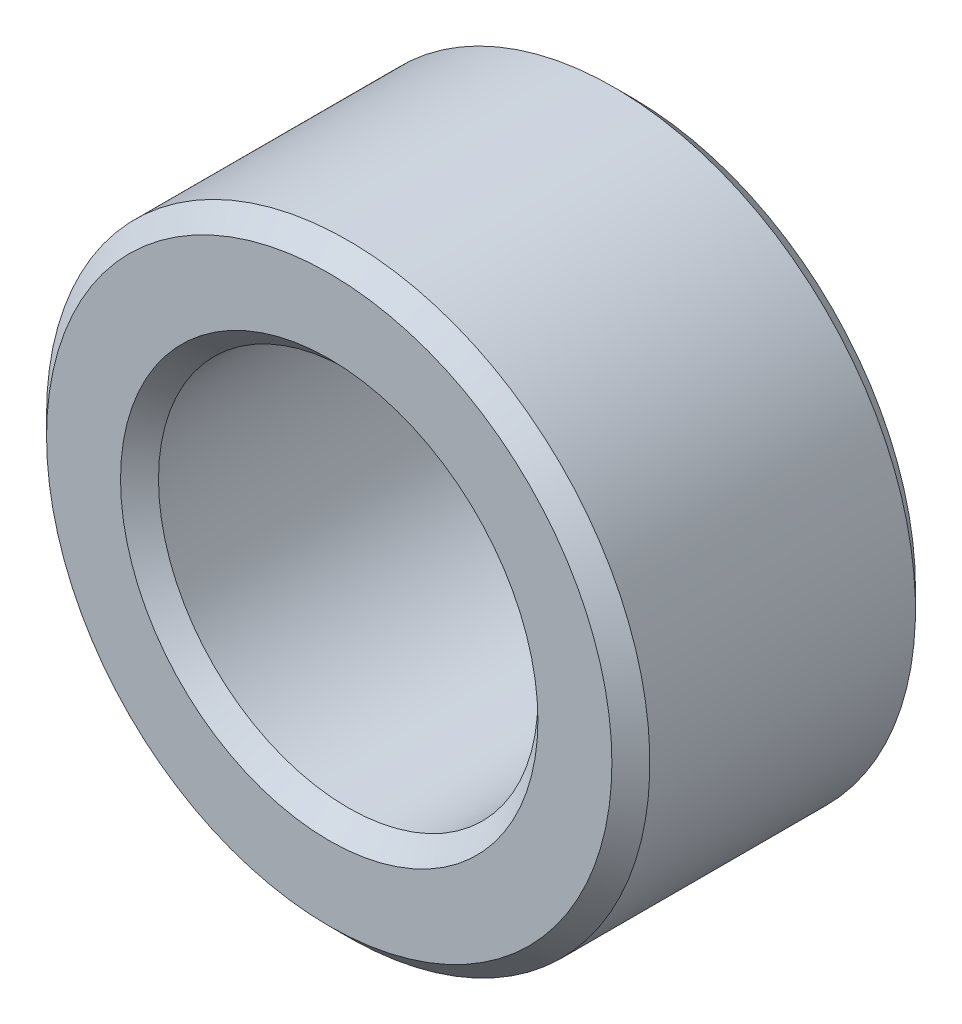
ISO-10303-21;
HEADER;
FILE_DESCRIPTION(('STEP AP214'),'2;1');
FILE_NAME('part.step','',(''),(''),'','','');
FILE_SCHEMA(('AUTOMOTIVE_DESIGN { 1 0 10303 214 1 1 1 1 }'));
ENDSEC;
DATA;
#1=APPLICATION_CONTEXT('core data for automotive mechanical design processes');
#2=APPLICATION_PROTOCOL_DEFINITION('international standard','automotive_design',2000,#1);
#3=PRODUCT_CONTEXT('',#1,'mechanical');
#4=PRODUCT('Part','Part','',(#3));
#5=PRODUCT_RELATED_PRODUCT_CATEGORY('part','',(#4));
#6=PRODUCT_DEFINITION_FORMATION('','',#4);
#7=PRODUCT_DEFINITION_CONTEXT('part definition',#1,'design');
#8=PRODUCT_DEFINITION('design','',#6,#7);
#9=PRODUCT_DEFINITION_SHAPE('','',#8);
#10=(LENGTH_UNIT() NAMED_UNIT(*) SI_UNIT(.MILLI.,.METRE.));
#11=(NAMED_UNIT(*) PLANE_ANGLE_UNIT() SI_UNIT($,.RADIAN.));
#12=(NAMED_UNIT(*) SI_UNIT($,.STERADIAN.) SOLID_ANGLE_UNIT());
#13=UNCERTAINTY_MEASURE_WITH_UNIT(LENGTH_MEASURE(1.E-05),#10,'distance_accuracy_value','');
#14=(GEOMETRIC_REPRESENTATION_CONTEXT(3) GLOBAL_UNCERTAINTY_ASSIGNED_CONTEXT((#13)) GLOBAL_UNIT_ASSIGNED_CONTEXT((#10,
#11,#12)) REPRESENTATION_CONTEXT('',''));
#15=CARTESIAN_POINT('',(0.,0.,0.));
#16=DIRECTION('',(0.,0.,1.));
#17=DIRECTION('',(1.,0.,0.));
#18=AXIS2_PLACEMENT_3D('',#15,#16,#17);
#19=CARTESIAN_POINT('',(0.,0.,8.));
#20=DIRECTION('',(0.,0.,-1.));
#21=DIRECTION('',(-1.,0.,0.));
#22=AXIS2_PLACEMENT_3D('',#19,#20,#21);
#23=CYLINDRICAL_SURFACE('',#22,5.);
#24=CARTESIAN_POINT('',(0.,0.,0.5));
#25=DIRECTION('',(0.,0.,-1.));
#26=DIRECTION('',(-1.,0.,0.));
#27=AXIS2_PLACEMENT_3D('',#24,#25,#26);
#28=CIRCLE('',#27,5.);
#29=CARTESIAN_POINT('',(-5.,0.,0.499999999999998));
#30=VERTEX_POINT('',#29);
#31=EDGE_CURVE('E40',#30,#30,#28,.T.);
#32=ORIENTED_EDGE('',*,*,#31,.T.);
#33=EDGE_LOOP('',(#32));
#34=FACE_BOUND('',#33,.T.);
#35=CARTESIAN_POINT('',(0.,0.,7.5));
#36=DIRECTION('',(0.,0.,-1.));
#37=DIRECTION('',(-1.,0.,0.));
#38=AXIS2_PLACEMENT_3D('',#35,#36,#37);
#39=CIRCLE('',#38,5.);
#40=CARTESIAN_POINT('',(-5.,0.,7.5));
#41=VERTEX_POINT('',#40);
#42=EDGE_CURVE('E43',#41,#41,#39,.F.);
#43=ORIENTED_EDGE('',*,*,#42,.T.);
#44=EDGE_LOOP('',(#43));
#45=FACE_BOUND('',#44,.T.);
#46=ADVANCED_FACE('F14',(#34,#45),#23,.F.);
#47=CARTESIAN_POINT('',(0.,0.,8.));
#48=DIRECTION('',(0.,0.,-1.));
#49=DIRECTION('',(-1.,0.,0.));
#50=AXIS2_PLACEMENT_3D('',#47,#48,#49);
#51=CYLINDRICAL_SURFACE('',#50,7.95);
#52=CARTESIAN_POINT('',(0.,0.,0.5));
#53=DIRECTION('',(0.,0.,-1.));
#54=DIRECTION('',(-1.,0.,0.));
#55=AXIS2_PLACEMENT_3D('',#52,#53,#54);
#56=CIRCLE('',#55,7.95);
#57=CARTESIAN_POINT('',(-7.95,0.,0.499999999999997));
#58=VERTEX_POINT('',#57);
#59=EDGE_CURVE('E25',#58,#58,#56,.F.);
#60=ORIENTED_EDGE('',*,*,#59,.T.);
#61=EDGE_LOOP('',(#60));
#62=FACE_BOUND('',#61,.T.);
#63=CARTESIAN_POINT('',(0.,0.,7.5));
#64=DIRECTION('',(0.,0.,-1.));
#65=DIRECTION('',(-1.,0.,0.));
#66=AXIS2_PLACEMENT_3D('',#63,#64,#65);
#67=CIRCLE('',#66,7.95);
#68=CARTESIAN_POINT('',(-7.95,0.,7.5));
#69=VERTEX_POINT('',#68);
#70=EDGE_CURVE('E29',#69,#69,#67,.T.);
#71=ORIENTED_EDGE('',*,*,#70,.T.);
#72=EDGE_LOOP('',(#71));
#73=FACE_BOUND('',#72,.T.);
#74=ADVANCED_FACE('F16',(#62,#73),#51,.T.);
#75=CARTESIAN_POINT('',(0.,0.,8.));
#76=DIRECTION('',(0.,0.,-1.));
#77=DIRECTION('',(-1.,0.,0.));
#78=AXIS2_PLACEMENT_3D('',#75,#76,#77);
#79=PLANE('',#78);
#80=CARTESIAN_POINT('',(0.,0.,8.));
#81=DIRECTION('',(0.,0.,-1.));
#82=DIRECTION('',(-1.,0.,0.));
#83=AXIS2_PLACEMENT_3D('',#80,#81,#82);
#84=CIRCLE('',#83,7.45);
#85=CARTESIAN_POINT('',(-7.45,0.,8.));
#86=VERTEX_POINT('',#85);
#87=EDGE_CURVE('E10',#86,#86,#84,.F.);
#88=ORIENTED_EDGE('',*,*,#87,.T.);
#89=EDGE_LOOP('',(#88));
#90=FACE_BOUND('',#89,.T.);
#91=CARTESIAN_POINT('',(0.,0.,8.));
#92=DIRECTION('',(0.,0.,-1.));
#93=DIRECTION('',(-1.,0.,0.));
#94=AXIS2_PLACEMENT_3D('',#91,#92,#93);
#95=CIRCLE('',#94,5.5);
#96=CARTESIAN_POINT('',(-5.5,0.,8.));
#97=VERTEX_POINT('',#96);
#98=EDGE_CURVE('E21',#97,#97,#95,.T.);
#99=ORIENTED_EDGE('',*,*,#98,.T.);
#100=EDGE_LOOP('',(#99));
#101=FACE_BOUND('',#100,.T.);
#102=ADVANCED_FACE('F65',(#90,#101),#79,.F.);
#103=CARTESIAN_POINT('',(0.,0.,0.));
#104=DIRECTION('',(0.,0.,-1.));
#105=DIRECTION('',(-1.,0.,0.));
#106=AXIS2_PLACEMENT_3D('',#103,#104,#105);
#107=PLANE('',#106);
#108=CARTESIAN_POINT('',(0.,0.,0.));
#109=DIRECTION('',(0.,0.,-1.));
#110=DIRECTION('',(-1.,0.,0.));
#111=AXIS2_PLACEMENT_3D('',#108,#109,#110);
#112=CIRCLE('',#111,5.5);
#113=CARTESIAN_POINT('',(-5.5,0.,0.));
#114=VERTEX_POINT('',#113);
#115=EDGE_CURVE('E34',#114,#114,#112,.F.);
#116=ORIENTED_EDGE('',*,*,#115,.T.);
#117=EDGE_LOOP('',(#116));
#118=FACE_BOUND('',#117,.T.);
#119=CARTESIAN_POINT('',(0.,0.,0.));
#120=DIRECTION('',(0.,0.,-1.));
#121=DIRECTION('',(-1.,0.,0.));
#122=AXIS2_PLACEMENT_3D('',#119,#120,#121);
#123=CIRCLE('',#122,7.45);
#124=CARTESIAN_POINT('',(-7.45,0.,0.));
#125=VERTEX_POINT('',#124);
#126=EDGE_CURVE('E37',#125,#125,#123,.T.);
#127=ORIENTED_EDGE('',*,*,#126,.T.);
#128=EDGE_LOOP('',(#127));
#129=FACE_BOUND('',#128,.T.);
#130=ADVANCED_FACE('F70',(#118,#129),#107,.T.);
#131=CARTESIAN_POINT('',(0.,0.,0.5));
#132=DIRECTION('',(0.,0.,-1.));
#133=DIRECTION('',(-1.,0.,0.));
#134=AXIS2_PLACEMENT_3D('',#131,#132,#133);
#135=CONICAL_SURFACE('',#134,5.,0.785398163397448);
#136=ORIENTED_EDGE('',*,*,#115,.F.);
#137=EDGE_LOOP('',(#136));
#138=FACE_BOUND('',#137,.T.);
#139=ORIENTED_EDGE('',*,*,#31,.F.);
#140=EDGE_LOOP('',(#139));
#141=FACE_BOUND('',#140,.T.);
#142=ADVANCED_FACE('F73',(#138,#141),#135,.F.);
#143=CARTESIAN_POINT('',(0.,0.,0.));
#144=DIRECTION('',(0.,0.,1.));
#145=DIRECTION('',(1.,0.,0.));
#146=AXIS2_PLACEMENT_3D('',#143,#144,#145);
#147=CONICAL_SURFACE('',#146,7.45,0.785398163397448);
#148=ORIENTED_EDGE('',*,*,#59,.F.);
#149=EDGE_LOOP('',(#148));
#150=FACE_BOUND('',#149,.T.);
#151=ORIENTED_EDGE('',*,*,#126,.F.);
#152=EDGE_LOOP('',(#151));
#153=FACE_BOUND('',#152,.T.);
#154=ADVANCED_FACE('F57',(#150,#153),#147,.T.);
#155=CARTESIAN_POINT('',(0.,0.,7.5));
#156=DIRECTION('',(0.,0.,-1.));
#157=DIRECTION('',(-1.,0.,0.));
#158=AXIS2_PLACEMENT_3D('',#155,#156,#157);
#159=CONICAL_SURFACE('',#158,7.95,0.785398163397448);
#160=ORIENTED_EDGE('',*,*,#87,.F.);
#161=EDGE_LOOP('',(#160));
#162=FACE_BOUND('',#161,.T.);
#163=ORIENTED_EDGE('',*,*,#70,.F.);
#164=EDGE_LOOP('',(#163));
#165=FACE_BOUND('',#164,.T.);
#166=ADVANCED_FACE('F51',(#162,#165),#159,.T.);
#167=CARTESIAN_POINT('',(0.,0.,8.));
#168=DIRECTION('',(0.,0.,1.));
#169=DIRECTION('',(1.,0.,0.));
#170=AXIS2_PLACEMENT_3D('',#167,#168,#169);
#171=CONICAL_SURFACE('',#170,5.5,0.785398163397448);
#172=ORIENTED_EDGE('',*,*,#42,.F.);
#173=EDGE_LOOP('',(#172));
#174=FACE_BOUND('',#173,.T.);
#175=ORIENTED_EDGE('',*,*,#98,.F.);
#176=EDGE_LOOP('',(#175));
#177=FACE_BOUND('',#176,.T.);
#178=ADVANCED_FACE('F48',(#174,#177),#171,.F.);
#179=CLOSED_SHELL('',(#46,#74,#102,#130,#142,#154,#166,#178));
#180=MANIFOLD_SOLID_BREP('B1',#179);
#181=ADVANCED_BREP_SHAPE_REPRESENTATION('',(#18,#180),#14);
#182=SHAPE_DEFINITION_REPRESENTATION(#9,#181);
ENDSEC;
END-ISO-10303-21;
